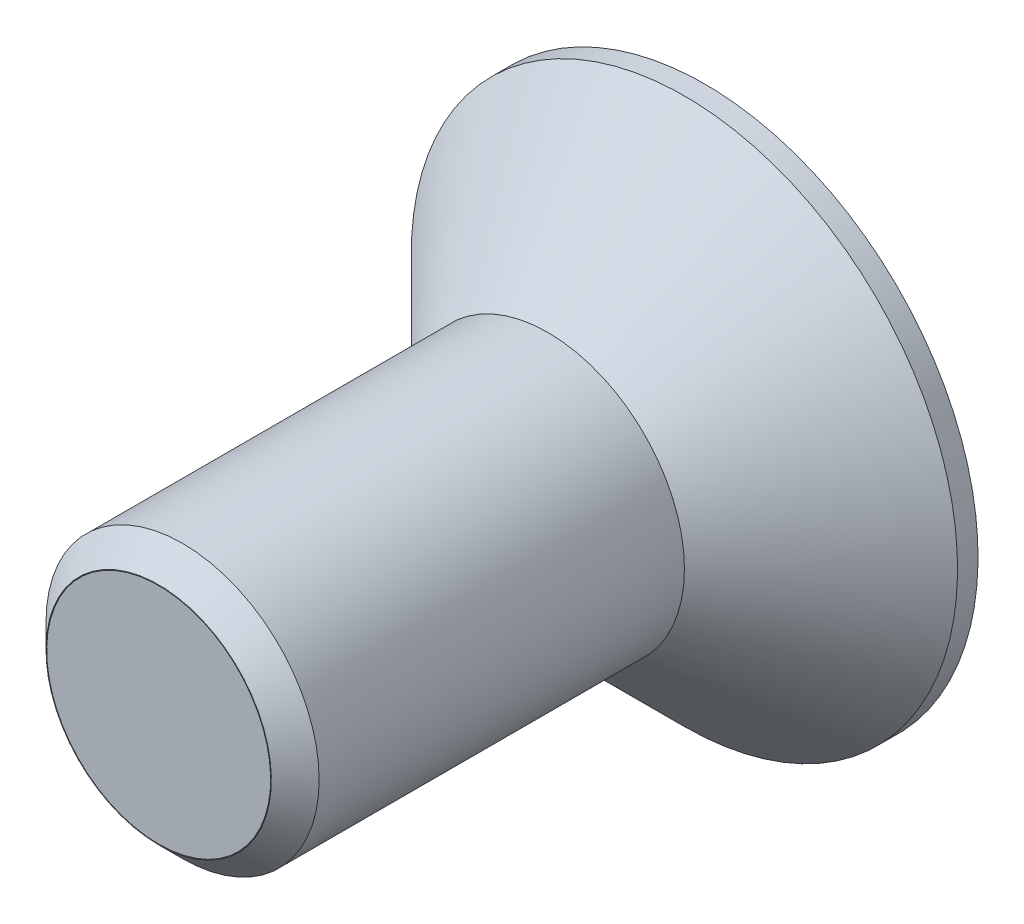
from build123d import *

# Parameters (mm, degrees)
CUT_EXTRUDE1_DEPTH = 0.95
CIRPATTERN1_COUNT  = 6


with BuildPart() as part:
    # Sketch1 → Revolve1 (revolve)
    with BuildSketch(Plane(origin=(0, 0, -16), x_dir=(0, 0, 1), z_dir=(-1, 0, 0)), mode=Mode.PRIVATE) as revolve1_sk:
        Polygon((16, 1.975), (16, 4), (16.3, 4), (18.3, 2), (23.65, 2), (24, 1.65), (20.74, 1.65), (20.4, 1.99), (20.39, 1.99), (20.74, 1.64), (24, 1.64), (24, 0), (16.05, 0), (16.05, 1.975), align=None)
    revolve(revolve1_sk.sketch.rotate(Axis((0, 0, 0.05), (0, 0, -1)), 180), axis=Axis((0, 0, 0.05), (0, 0, -1)))

    # Sketch2 → Cut-Extrude1 (cut)
    with BuildSketch(Plane(origin=(0, 0, 0), x_dir=(-1, 0, 0), z_dir=(0, 0, -1))):
        with BuildLine():
            Line((0, 0), (0.653606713, 1.132080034))
            ThreePointArc((0.653606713, 1.132080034), (0.46429346, 1.321393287), (0.395, 1.58))
            ThreePointArc((0.395, 1.58), (0, 1.975), (-0.395, 1.58))
            ThreePointArc((-0.395, 1.58), (-0.46429346, 1.321393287), (-0.653606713, 1.132080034))
            Line((-0.653606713, 1.132080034), (0, 0))
        make_face()
    cut_extrude1 = extrude(amount=-CUT_EXTRUDE1_DEPTH, mode=Mode.SUBTRACT)

    # CirPattern1: Cut-Extrude1 ×6 about axis
    cirpattern1_axis = Axis((0, 0, 0), (0, 0, 1))
    for i in range(1, CIRPATTERN1_COUNT):
        add(cut_extrude1.rotate(cirpattern1_axis, i * 360 / CIRPATTERN1_COUNT), mode=Mode.SUBTRACT)


solid = part.part
